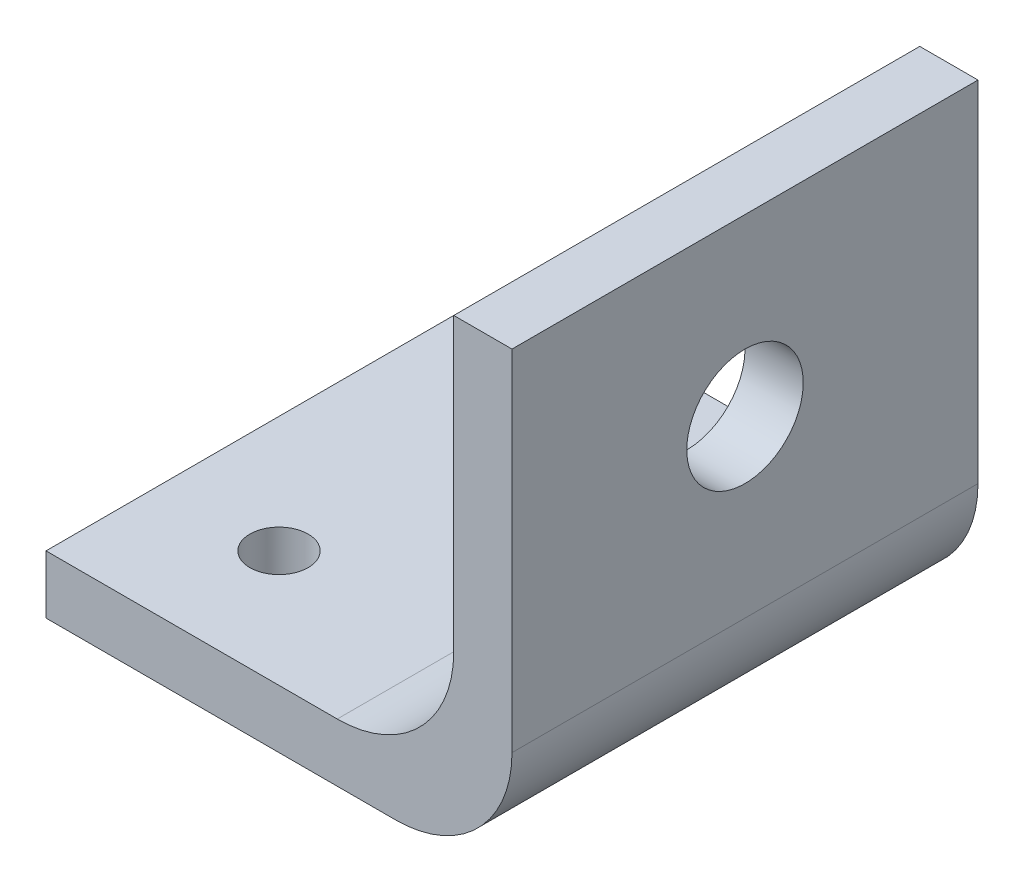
from build123d import *

# Parameters (mm, degrees)
BOSS_EXTRUDE1_DEPTH = 40
SKETCH2_R           = 2.5
CUT_EXTRUDE1_DEPTH  = 40
SKETCH3_R           = 5
CUT_EXTRUDE2_DEPTH  = 40


with BuildPart() as part:
    # Sketch1 → Boss-Extrude1 (new body)
    with BuildSketch(Plane.XY):
        with BuildLine():
            Line((0, 0), (30, 0))
            ThreePointArc((30, 0), (37.071067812, 2.928932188), (40, 10))
            Line((40, 10), (40, 40))
            Line((40, 40), (35, 40))
            Line((35, 40), (35, 15))
            ThreePointArc((35, 15), (32.071067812, 7.928932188), (25, 5))
            Line((25, 5), (0, 5))
            Line((0, 5), (0, 0))
        make_face()
    extrude(amount=BOSS_EXTRUDE1_DEPTH)

    # Sketch2 → Cut-Extrude1 (cut)
    with BuildSketch(Plane.XZ):
        with Locations(Location((10, 30, 0), (0, 0, 270))):
            Circle(SKETCH2_R)
        with Locations(Location((10, 10, 0), (0, 0, 270))):
            Circle(SKETCH2_R)
    extrude(amount=-CUT_EXTRUDE1_DEPTH, mode=Mode.SUBTRACT)

    # Sketch3 → Cut-Extrude2 (cut)
    with BuildSketch(Plane(origin=(40, 0, 0), x_dir=(0, 0, -1), z_dir=(1, 0, 0))):
        with Locations(Location((-20, 25, 0), (0, 0, 90))):
            Circle(SKETCH3_R)
    extrude(amount=-CUT_EXTRUDE2_DEPTH, mode=Mode.SUBTRACT)


solid = part.part
